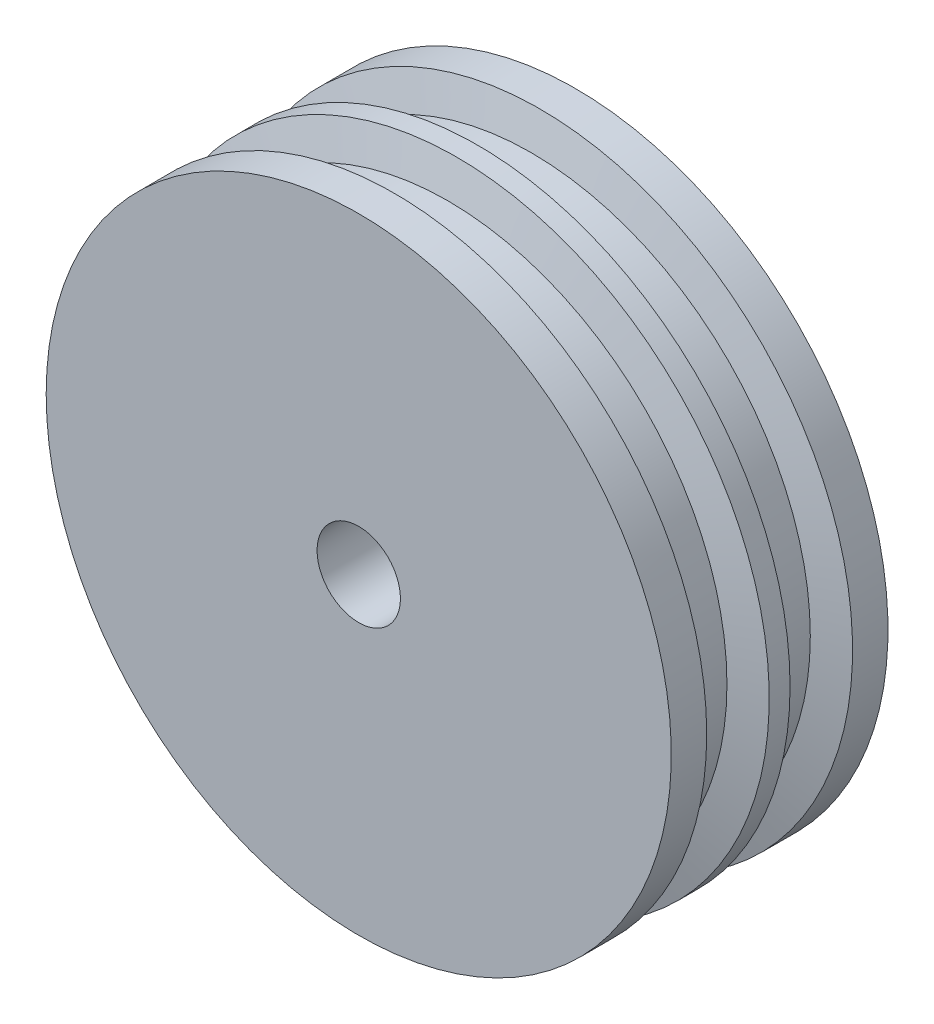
from build123d import *

# Parameters (mm, degrees)
SKIZZE1_R               = 75
SKIZZE1_R_2             = 10
LINEAR_AUSTRAGEN1_DEPTH = 26
LINEARES_MUSTER1_COUNT  = 2
LINEARES_MUSTER1_PITCH  = 20


with BuildPart() as part:
    # Skizze1 → Linear austragen1 (new, symmetric)
    with BuildSketch(Plane.XY):
        with Locations(Location((0, 0, 0), (0, 0, 180))):
            Circle(SKIZZE1_R)
        with Locations(Location((0, 0, 0), (0, 0, 180))):
            Circle(SKIZZE1_R_2, mode=Mode.SUBTRACT)
    extrude(amount=LINEAR_AUSTRAGEN1_DEPTH, both=True)

    # Skizze2 → Schnitt-Rotation1 (revolve, cut)
    with BuildSketch(Plane(origin=(0, 0, 0), x_dir=(0, 0, -1), z_dir=(1, 0, 0)), mode=Mode.PRIVATE) as schnitt_rotation1_sk:
        Polygon((-17.5, 75), (-2.5, 75), (-4.643593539, 67), (-15.356406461, 67), align=None)
    schnitt_rotation1 = revolve(schnitt_rotation1_sk.sketch.rotate(Axis((0, 0, 0), (0, 0, -1)), 270), axis=Axis((0, 0, 0), (0, 0, -1)), mode=Mode.SUBTRACT)

    # Lineares Muster1: Schnitt-Rotation1 ×2
    with Locations(*[(0, 0, -i * LINEARES_MUSTER1_PITCH) for i in range(1, LINEARES_MUSTER1_COUNT)]):
        add(schnitt_rotation1, mode=Mode.SUBTRACT)


solid = part.part
